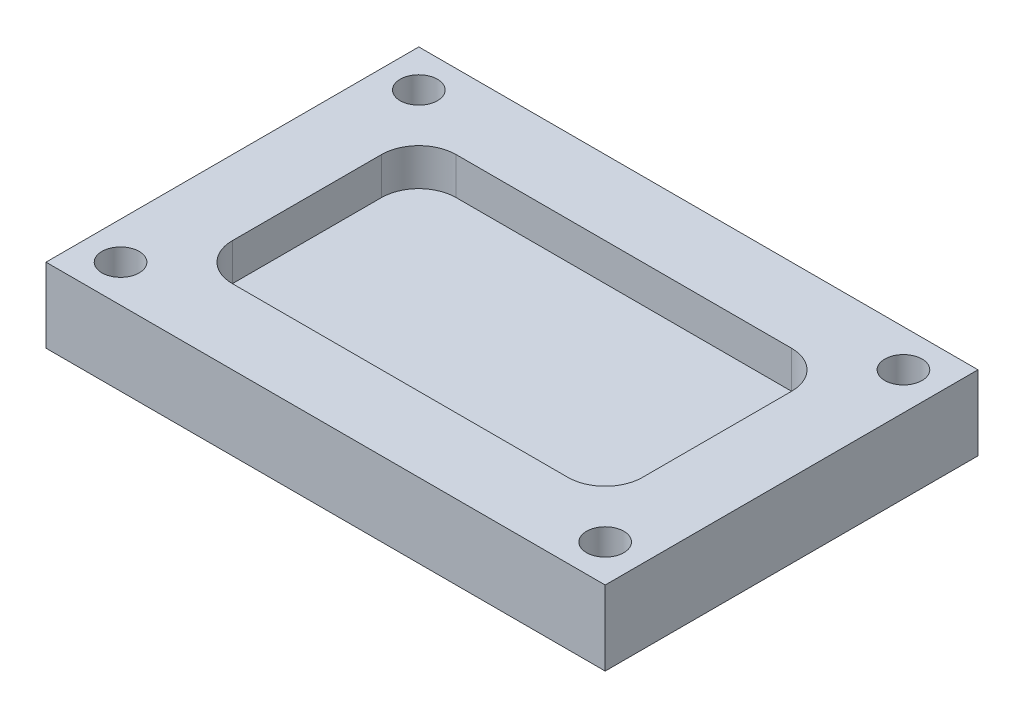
from build123d import *

# Parameters (mm, degrees)
SKETCH1_W                  = 150
SKETCH1_H                  = 100
BOSS_EXTRUDE1_DEPTH        = 20
F_10_0MM_DOWEL_HOLE1_D     = 10
F_10_0MM_DOWEL_HOLE1_DEPTH = 10
F_10_0MM_DOWEL_HOLE1_TIP   = 3.004303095
CUT_EXTRUDE1_DEPTH         = 10


with BuildPart() as part:
    # Sketch1 → Boss-Extrude1 (new body)
    with BuildSketch(Plane(origin=(0, 0, 0), x_dir=(1, 0, 0), z_dir=(0, 1, 0))):
        Rectangle(SKETCH1_W, SKETCH1_H)
    extrude(amount=BOSS_EXTRUDE1_DEPTH)

    # 10.0mm Dowel Hole1
    with Locations(Plane(origin=(-65, 20, -40), x_dir=(0, 0, 1), z_dir=(0, 1, 0))):
        with Locations((0, 0), (80, 0), (80, 130), (0, 130)):
            Hole(F_10_0MM_DOWEL_HOLE1_D / 2, depth=F_10_0MM_DOWEL_HOLE1_DEPTH)
            with Locations((0, 0, -(F_10_0MM_DOWEL_HOLE1_DEPTH + F_10_0MM_DOWEL_HOLE1_TIP / 2))):  # 118° drill point
                Cone(0, F_10_0MM_DOWEL_HOLE1_D / 2, F_10_0MM_DOWEL_HOLE1_TIP, mode=Mode.SUBTRACT)

    # Sketch4 → Cut-Extrude1 (cut)
    with BuildSketch(Plane(origin=(0, 20, 0), x_dir=(1, 0, 0), z_dir=(0, 1, 0))):
        with BuildLine():
            Line((55, -20), (55, 20))
            ThreePointArc((55, 20), (52.071067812, 27.071067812), (45, 30))
            Line((45, 30), (-45, 30))
            ThreePointArc((-45, 30), (-52.071067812, 27.071067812), (-55, 20))
            Line((-55, 20), (-55, -20))
            ThreePointArc((-55, -20), (-52.071067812, -27.071067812), (-45, -30))
            Line((-45, -30), (45, -30))
            ThreePointArc((45, -30), (52.071067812, -27.071067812), (55, -20))
        make_face()
    extrude(amount=-CUT_EXTRUDE1_DEPTH, mode=Mode.SUBTRACT)


solid = part.part
